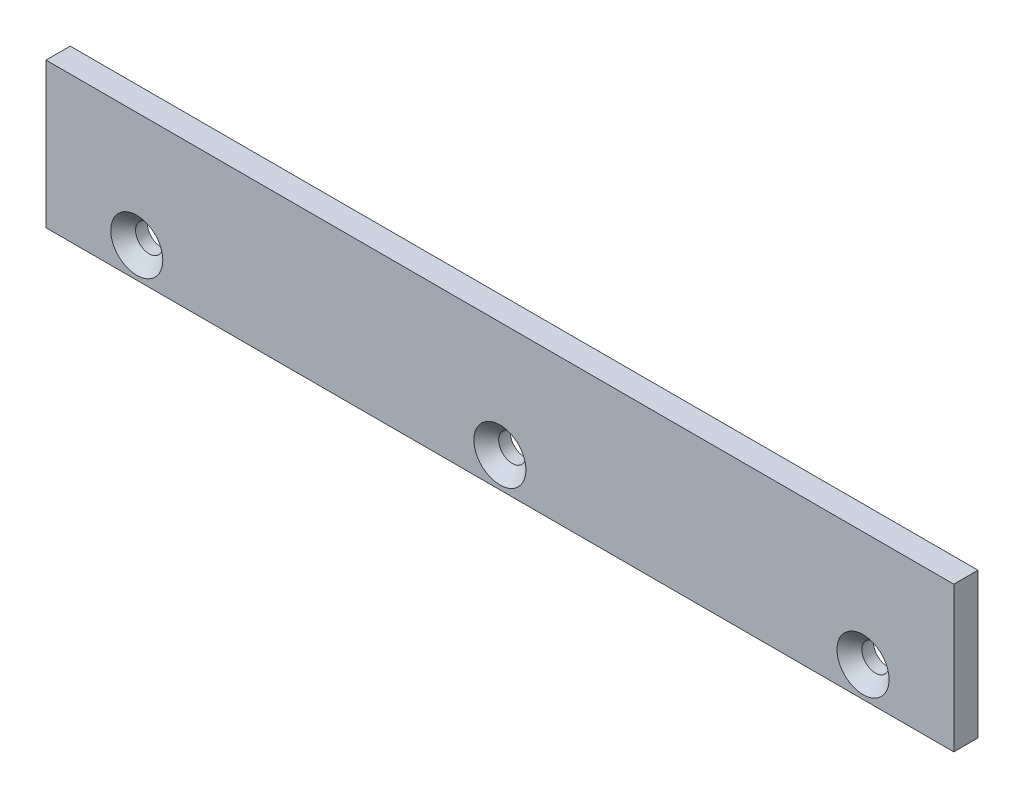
ISO-10303-21;
HEADER;
FILE_DESCRIPTION(('STEP AP214'),'2;1');
FILE_NAME('part.step','',(''),(''),'','','');
FILE_SCHEMA(('AUTOMOTIVE_DESIGN { 1 0 10303 214 1 1 1 1 }'));
ENDSEC;
DATA;
#1=APPLICATION_CONTEXT('core data for automotive mechanical design processes');
#2=APPLICATION_PROTOCOL_DEFINITION('international standard','automotive_design',2000,#1);
#3=PRODUCT_CONTEXT('',#1,'mechanical');
#4=PRODUCT('Part','Part','',(#3));
#5=PRODUCT_RELATED_PRODUCT_CATEGORY('part','',(#4));
#6=PRODUCT_DEFINITION_FORMATION('','',#4);
#7=PRODUCT_DEFINITION_CONTEXT('part definition',#1,'design');
#8=PRODUCT_DEFINITION('design','',#6,#7);
#9=PRODUCT_DEFINITION_SHAPE('','',#8);
#10=(LENGTH_UNIT() NAMED_UNIT(*) SI_UNIT(.MILLI.,.METRE.));
#11=(NAMED_UNIT(*) PLANE_ANGLE_UNIT() SI_UNIT($,.RADIAN.));
#12=(NAMED_UNIT(*) SI_UNIT($,.STERADIAN.) SOLID_ANGLE_UNIT());
#13=UNCERTAINTY_MEASURE_WITH_UNIT(LENGTH_MEASURE(1.E-05),#10,'distance_accuracy_value','');
#14=(GEOMETRIC_REPRESENTATION_CONTEXT(3) GLOBAL_UNCERTAINTY_ASSIGNED_CONTEXT((#13)) GLOBAL_UNIT_ASSIGNED_CONTEXT((#10,
#11,#12)) REPRESENTATION_CONTEXT('',''));
#15=CARTESIAN_POINT('',(0.,0.,0.));
#16=DIRECTION('',(0.,0.,1.));
#17=DIRECTION('',(1.,0.,0.));
#18=AXIS2_PLACEMENT_3D('',#15,#16,#17);
#19=CARTESIAN_POINT('',(0.,-3.70786669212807,4.));
#20=DIRECTION('',(-1.,0.,0.));
#21=DIRECTION('',(0.,-1.,0.));
#22=AXIS2_PLACEMENT_3D('',#19,#20,#21);
#23=PLANE('',#22);
#24=DIRECTION('',(0.,1.,0.));
#25=VECTOR('',#24,1.);
#26=CARTESIAN_POINT('',(0.,-3.70786669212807,0.));
#27=LINE('',#26,#25);
#28=CARTESIAN_POINT('',(0.,-27.7078666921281,0.));
#29=VERTEX_POINT('',#28);
#30=CARTESIAN_POINT('',(0.,-3.70786669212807,0.));
#31=VERTEX_POINT('',#30);
#32=EDGE_CURVE('E79',#29,#31,#27,.T.);
#33=ORIENTED_EDGE('',*,*,#32,.T.);
#34=DIRECTION('',(0.,0.,-1.));
#35=VECTOR('',#34,1.);
#36=CARTESIAN_POINT('',(0.,-3.70786669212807,4.));
#37=LINE('',#36,#35);
#38=CARTESIAN_POINT('',(0.,-3.70786669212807,4.));
#39=VERTEX_POINT('',#38);
#40=EDGE_CURVE('E11',#39,#31,#37,.T.);
#41=ORIENTED_EDGE('',*,*,#40,.F.);
#42=DIRECTION('',(0.,1.,0.));
#43=VECTOR('',#42,1.);
#44=CARTESIAN_POINT('',(0.,-3.70786669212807,4.));
#45=LINE('',#44,#43);
#46=CARTESIAN_POINT('',(0.,-27.7078666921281,4.));
#47=VERTEX_POINT('',#46);
#48=EDGE_CURVE('E67',#47,#39,#45,.T.);
#49=ORIENTED_EDGE('',*,*,#48,.F.);
#50=DIRECTION('',(0.,0.,-1.));
#51=VECTOR('',#50,1.);
#52=CARTESIAN_POINT('',(0.,-27.7078666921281,4.));
#53=LINE('',#52,#51);
#54=EDGE_CURVE('E75',#47,#29,#53,.T.);
#55=ORIENTED_EDGE('',*,*,#54,.T.);
#56=EDGE_LOOP('',(#33,#41,#49,#55));
#57=FACE_BOUND('',#56,.T.);
#58=ADVANCED_FACE('F16',(#57),#23,.F.);
#59=CARTESIAN_POINT('',(0.,-3.70786669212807,4.));
#60=DIRECTION('',(0.,-1.,0.));
#61=DIRECTION('',(1.,0.,0.));
#62=AXIS2_PLACEMENT_3D('',#59,#60,#61);
#63=PLANE('',#62);
#64=DIRECTION('',(-1.,0.,0.));
#65=VECTOR('',#64,1.);
#66=CARTESIAN_POINT('',(0.,-3.70786669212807,0.));
#67=LINE('',#66,#65);
#68=CARTESIAN_POINT('',(-150.,-3.70786669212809,0.));
#69=VERTEX_POINT('',#68);
#70=EDGE_CURVE('E71',#31,#69,#67,.T.);
#71=ORIENTED_EDGE('',*,*,#70,.T.);
#72=DIRECTION('',(0.,0.,-1.));
#73=VECTOR('',#72,1.);
#74=CARTESIAN_POINT('',(-150.,-3.70786669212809,4.));
#75=LINE('',#74,#73);
#76=CARTESIAN_POINT('',(-150.,-3.70786669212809,4.));
#77=VERTEX_POINT('',#76);
#78=EDGE_CURVE('E24',#77,#69,#75,.T.);
#79=ORIENTED_EDGE('',*,*,#78,.F.);
#80=DIRECTION('',(-1.,0.,0.));
#81=VECTOR('',#80,1.);
#82=CARTESIAN_POINT('',(0.,-3.70786669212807,4.));
#83=LINE('',#82,#81);
#84=EDGE_CURVE('E62',#39,#77,#83,.T.);
#85=ORIENTED_EDGE('',*,*,#84,.F.);
#86=ORIENTED_EDGE('',*,*,#40,.T.);
#87=EDGE_LOOP('',(#71,#79,#85,#86));
#88=FACE_BOUND('',#87,.T.);
#89=ADVANCED_FACE('F70',(#88),#63,.F.);
#90=CARTESIAN_POINT('',(-150.,-3.70786669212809,4.));
#91=DIRECTION('',(1.,0.,0.));
#92=DIRECTION('',(0.,0.,-1.));
#93=AXIS2_PLACEMENT_3D('',#90,#91,#92);
#94=PLANE('',#93);
#95=DIRECTION('',(0.,-1.,0.));
#96=VECTOR('',#95,1.);
#97=CARTESIAN_POINT('',(-150.,-3.70786669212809,0.));
#98=LINE('',#97,#96);
#99=CARTESIAN_POINT('',(-150.,-27.7078666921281,0.));
#100=VERTEX_POINT('',#99);
#101=EDGE_CURVE('E49',#69,#100,#98,.T.);
#102=ORIENTED_EDGE('',*,*,#101,.T.);
#103=DIRECTION('',(0.,0.,-1.));
#104=VECTOR('',#103,1.);
#105=CARTESIAN_POINT('',(-150.,-27.7078666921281,4.));
#106=LINE('',#105,#104);
#107=CARTESIAN_POINT('',(-150.,-27.7078666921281,4.));
#108=VERTEX_POINT('',#107);
#109=EDGE_CURVE('E72',#108,#100,#106,.T.);
#110=ORIENTED_EDGE('',*,*,#109,.F.);
#111=DIRECTION('',(0.,-1.,0.));
#112=VECTOR('',#111,1.);
#113=CARTESIAN_POINT('',(-150.,-3.70786669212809,4.));
#114=LINE('',#113,#112);
#115=EDGE_CURVE('E65',#77,#108,#114,.T.);
#116=ORIENTED_EDGE('',*,*,#115,.F.);
#117=ORIENTED_EDGE('',*,*,#78,.T.);
#118=EDGE_LOOP('',(#102,#110,#116,#117));
#119=FACE_BOUND('',#118,.T.);
#120=ADVANCED_FACE('F73',(#119),#94,.F.);
#121=CARTESIAN_POINT('',(0.,-27.7078666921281,4.));
#122=DIRECTION('',(0.,1.,0.));
#123=DIRECTION('',(-1.,0.,0.));
#124=AXIS2_PLACEMENT_3D('',#121,#122,#123);
#125=PLANE('',#124);
#126=DIRECTION('',(1.,0.,0.));
#127=VECTOR('',#126,1.);
#128=CARTESIAN_POINT('',(0.,-27.7078666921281,0.));
#129=LINE('',#128,#127);
#130=EDGE_CURVE('E55',#100,#29,#129,.T.);
#131=ORIENTED_EDGE('',*,*,#130,.T.);
#132=ORIENTED_EDGE('',*,*,#54,.F.);
#133=DIRECTION('',(1.,0.,0.));
#134=VECTOR('',#133,1.);
#135=CARTESIAN_POINT('',(0.,-27.7078666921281,4.));
#136=LINE('',#135,#134);
#137=EDGE_CURVE('E32',#108,#47,#136,.T.);
#138=ORIENTED_EDGE('',*,*,#137,.F.);
#139=ORIENTED_EDGE('',*,*,#109,.T.);
#140=EDGE_LOOP('',(#131,#132,#138,#139));
#141=FACE_BOUND('',#140,.T.);
#142=ADVANCED_FACE('F87',(#141),#125,.F.);
#143=CARTESIAN_POINT('',(0.,0.,4.));
#144=DIRECTION('',(0.,0.,-1.));
#145=DIRECTION('',(-1.,0.,0.));
#146=AXIS2_PLACEMENT_3D('',#143,#144,#145);
#147=PLANE('',#146);
#148=CARTESIAN_POINT('',(-135.,-22.7078666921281,4.));
#149=DIRECTION('',(0.,0.,1.));
#150=DIRECTION('',(1.,0.,0.));
#151=AXIS2_PLACEMENT_3D('',#148,#149,#150);
#152=CIRCLE('',#151,4.3);
#153=CARTESIAN_POINT('',(-130.7,-22.7078666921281,4.));
#154=VERTEX_POINT('',#153);
#155=EDGE_CURVE('E116',#154,#154,#152,.T.);
#156=ORIENTED_EDGE('',*,*,#155,.F.);
#157=EDGE_LOOP('',(#156));
#158=FACE_BOUND('',#157,.T.);
#159=CARTESIAN_POINT('',(-75.,-22.7078666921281,4.));
#160=DIRECTION('',(0.,0.,1.));
#161=DIRECTION('',(1.,0.,0.));
#162=AXIS2_PLACEMENT_3D('',#159,#160,#161);
#163=CIRCLE('',#162,4.3);
#164=CARTESIAN_POINT('',(-70.7,-22.7078666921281,4.));
#165=VERTEX_POINT('',#164);
#166=EDGE_CURVE('E107',#165,#165,#163,.T.);
#167=ORIENTED_EDGE('',*,*,#166,.F.);
#168=EDGE_LOOP('',(#167));
#169=FACE_BOUND('',#168,.T.);
#170=CARTESIAN_POINT('',(-15.,-22.7078666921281,4.));
#171=DIRECTION('',(0.,0.,1.));
#172=DIRECTION('',(1.,0.,0.));
#173=AXIS2_PLACEMENT_3D('',#170,#171,#172);
#174=CIRCLE('',#173,4.3);
#175=CARTESIAN_POINT('',(-10.7,-22.7078666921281,4.));
#176=VERTEX_POINT('',#175);
#177=EDGE_CURVE('E98',#176,#176,#174,.T.);
#178=ORIENTED_EDGE('',*,*,#177,.F.);
#179=EDGE_LOOP('',(#178));
#180=FACE_BOUND('',#179,.T.);
#181=ORIENTED_EDGE('',*,*,#48,.T.);
#182=ORIENTED_EDGE('',*,*,#84,.T.);
#183=ORIENTED_EDGE('',*,*,#115,.T.);
#184=ORIENTED_EDGE('',*,*,#137,.T.);
#185=EDGE_LOOP('',(#181,#182,#183,#184));
#186=FACE_BOUND('',#185,.T.);
#187=ADVANCED_FACE('F63',(#158,#169,#180,#186),#147,.F.);
#188=CARTESIAN_POINT('',(0.,0.,0.));
#189=DIRECTION('',(0.,0.,-1.));
#190=DIRECTION('',(-1.,0.,0.));
#191=AXIS2_PLACEMENT_3D('',#188,#189,#190);
#192=PLANE('',#191);
#193=CARTESIAN_POINT('',(-135.,-22.7078666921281,0.));
#194=DIRECTION('',(0.,0.,1.));
#195=DIRECTION('',(1.,0.,0.));
#196=AXIS2_PLACEMENT_3D('',#193,#194,#195);
#197=CIRCLE('',#196,2.25);
#198=CARTESIAN_POINT('',(-132.75,-22.7078666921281,0.));
#199=VERTEX_POINT('',#198);
#200=EDGE_CURVE('E110',#199,#199,#197,.T.);
#201=ORIENTED_EDGE('',*,*,#200,.T.);
#202=EDGE_LOOP('',(#201));
#203=FACE_BOUND('',#202,.T.);
#204=CARTESIAN_POINT('',(-75.,-22.7078666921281,0.));
#205=DIRECTION('',(0.,0.,1.));
#206=DIRECTION('',(1.,0.,0.));
#207=AXIS2_PLACEMENT_3D('',#204,#205,#206);
#208=CIRCLE('',#207,2.25);
#209=CARTESIAN_POINT('',(-72.75,-22.7078666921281,0.));
#210=VERTEX_POINT('',#209);
#211=EDGE_CURVE('E101',#210,#210,#208,.T.);
#212=ORIENTED_EDGE('',*,*,#211,.T.);
#213=EDGE_LOOP('',(#212));
#214=FACE_BOUND('',#213,.T.);
#215=CARTESIAN_POINT('',(-15.,-22.7078666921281,0.));
#216=DIRECTION('',(0.,0.,1.));
#217=DIRECTION('',(1.,0.,0.));
#218=AXIS2_PLACEMENT_3D('',#215,#216,#217);
#219=CIRCLE('',#218,2.25);
#220=CARTESIAN_POINT('',(-12.75,-22.7078666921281,0.));
#221=VERTEX_POINT('',#220);
#222=EDGE_CURVE('E82',#221,#221,#219,.T.);
#223=ORIENTED_EDGE('',*,*,#222,.T.);
#224=EDGE_LOOP('',(#223));
#225=FACE_BOUND('',#224,.T.);
#226=ORIENTED_EDGE('',*,*,#32,.F.);
#227=ORIENTED_EDGE('',*,*,#130,.F.);
#228=ORIENTED_EDGE('',*,*,#101,.F.);
#229=ORIENTED_EDGE('',*,*,#70,.F.);
#230=EDGE_LOOP('',(#226,#227,#228,#229));
#231=FACE_BOUND('',#230,.T.);
#232=ADVANCED_FACE('F90',(#203,#214,#225,#231),#192,.T.);
#233=CARTESIAN_POINT('',(-15.,-22.7078666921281,4.));
#234=DIRECTION('',(0.,0.,1.));
#235=DIRECTION('',(1.,0.,0.));
#236=AXIS2_PLACEMENT_3D('',#233,#234,#235);
#237=CYLINDRICAL_SURFACE('',#236,2.25);
#238=ORIENTED_EDGE('',*,*,#222,.F.);
#239=EDGE_LOOP('',(#238));
#240=FACE_BOUND('',#239,.T.);
#241=CARTESIAN_POINT('',(-15.,-22.7078666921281,1.95));
#242=DIRECTION('',(0.,0.,1.));
#243=DIRECTION('',(1.,0.,0.));
#244=AXIS2_PLACEMENT_3D('',#241,#242,#243);
#245=CIRCLE('',#244,2.25);
#246=CARTESIAN_POINT('',(-12.75,-22.7078666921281,1.95));
#247=VERTEX_POINT('',#246);
#248=EDGE_CURVE('E95',#247,#247,#245,.T.);
#249=ORIENTED_EDGE('',*,*,#248,.T.);
#250=EDGE_LOOP('',(#249));
#251=FACE_BOUND('',#250,.T.);
#252=ADVANCED_FACE('F132',(#240,#251),#237,.F.);
#253=CARTESIAN_POINT('',(-15.,-22.7078666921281,4.));
#254=DIRECTION('',(0.,0.,1.));
#255=DIRECTION('',(1.,0.,0.));
#256=AXIS2_PLACEMENT_3D('',#253,#254,#255);
#257=CONICAL_SURFACE('',#256,4.3,0.785398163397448);
#258=ORIENTED_EDGE('',*,*,#248,.F.);
#259=EDGE_LOOP('',(#258));
#260=FACE_BOUND('',#259,.T.);
#261=ORIENTED_EDGE('',*,*,#177,.T.);
#262=EDGE_LOOP('',(#261));
#263=FACE_BOUND('',#262,.T.);
#264=ADVANCED_FACE('F129',(#260,#263),#257,.F.);
#265=CARTESIAN_POINT('',(-75.,-22.7078666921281,4.));
#266=DIRECTION('',(0.,0.,1.));
#267=DIRECTION('',(1.,0.,0.));
#268=AXIS2_PLACEMENT_3D('',#265,#266,#267);
#269=CYLINDRICAL_SURFACE('',#268,2.25);
#270=ORIENTED_EDGE('',*,*,#211,.F.);
#271=EDGE_LOOP('',(#270));
#272=FACE_BOUND('',#271,.T.);
#273=CARTESIAN_POINT('',(-75.,-22.7078666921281,1.95));
#274=DIRECTION('',(0.,0.,1.));
#275=DIRECTION('',(1.,0.,0.));
#276=AXIS2_PLACEMENT_3D('',#273,#274,#275);
#277=CIRCLE('',#276,2.25);
#278=CARTESIAN_POINT('',(-72.75,-22.7078666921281,1.95));
#279=VERTEX_POINT('',#278);
#280=EDGE_CURVE('E104',#279,#279,#277,.T.);
#281=ORIENTED_EDGE('',*,*,#280,.T.);
#282=EDGE_LOOP('',(#281));
#283=FACE_BOUND('',#282,.T.);
#284=ADVANCED_FACE('F131',(#272,#283),#269,.F.);
#285=CARTESIAN_POINT('',(-75.,-22.7078666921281,4.));
#286=DIRECTION('',(0.,0.,1.));
#287=DIRECTION('',(1.,0.,0.));
#288=AXIS2_PLACEMENT_3D('',#285,#286,#287);
#289=CONICAL_SURFACE('',#288,4.3,0.785398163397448);
#290=ORIENTED_EDGE('',*,*,#280,.F.);
#291=EDGE_LOOP('',(#290));
#292=FACE_BOUND('',#291,.T.);
#293=ORIENTED_EDGE('',*,*,#166,.T.);
#294=EDGE_LOOP('',(#293));
#295=FACE_BOUND('',#294,.T.);
#296=ADVANCED_FACE('F141',(#292,#295),#289,.F.);
#297=CARTESIAN_POINT('',(-135.,-22.7078666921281,4.));
#298=DIRECTION('',(0.,0.,1.));
#299=DIRECTION('',(1.,0.,0.));
#300=AXIS2_PLACEMENT_3D('',#297,#298,#299);
#301=CYLINDRICAL_SURFACE('',#300,2.25);
#302=ORIENTED_EDGE('',*,*,#200,.F.);
#303=EDGE_LOOP('',(#302));
#304=FACE_BOUND('',#303,.T.);
#305=CARTESIAN_POINT('',(-135.,-22.7078666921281,1.95));
#306=DIRECTION('',(0.,0.,1.));
#307=DIRECTION('',(1.,0.,0.));
#308=AXIS2_PLACEMENT_3D('',#305,#306,#307);
#309=CIRCLE('',#308,2.25);
#310=CARTESIAN_POINT('',(-132.75,-22.7078666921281,1.95));
#311=VERTEX_POINT('',#310);
#312=EDGE_CURVE('E113',#311,#311,#309,.T.);
#313=ORIENTED_EDGE('',*,*,#312,.T.);
#314=EDGE_LOOP('',(#313));
#315=FACE_BOUND('',#314,.T.);
#316=ADVANCED_FACE('F176',(#304,#315),#301,.F.);
#317=CARTESIAN_POINT('',(-135.,-22.7078666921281,4.));
#318=DIRECTION('',(0.,0.,1.));
#319=DIRECTION('',(1.,0.,0.));
#320=AXIS2_PLACEMENT_3D('',#317,#318,#319);
#321=CONICAL_SURFACE('',#320,4.3,0.785398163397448);
#322=ORIENTED_EDGE('',*,*,#312,.F.);
#323=EDGE_LOOP('',(#322));
#324=FACE_BOUND('',#323,.T.);
#325=ORIENTED_EDGE('',*,*,#155,.T.);
#326=EDGE_LOOP('',(#325));
#327=FACE_BOUND('',#326,.T.);
#328=ADVANCED_FACE('F120',(#324,#327),#321,.F.);
#329=CLOSED_SHELL('',(#58,#89,#120,#142,#187,#232,#252,#264,#284,#296,#316,#328));
#330=MANIFOLD_SOLID_BREP('B1',#329);
#331=ADVANCED_BREP_SHAPE_REPRESENTATION('',(#18,#330),#14);
#332=SHAPE_DEFINITION_REPRESENTATION(#9,#331);
ENDSEC;
END-ISO-10303-21;
